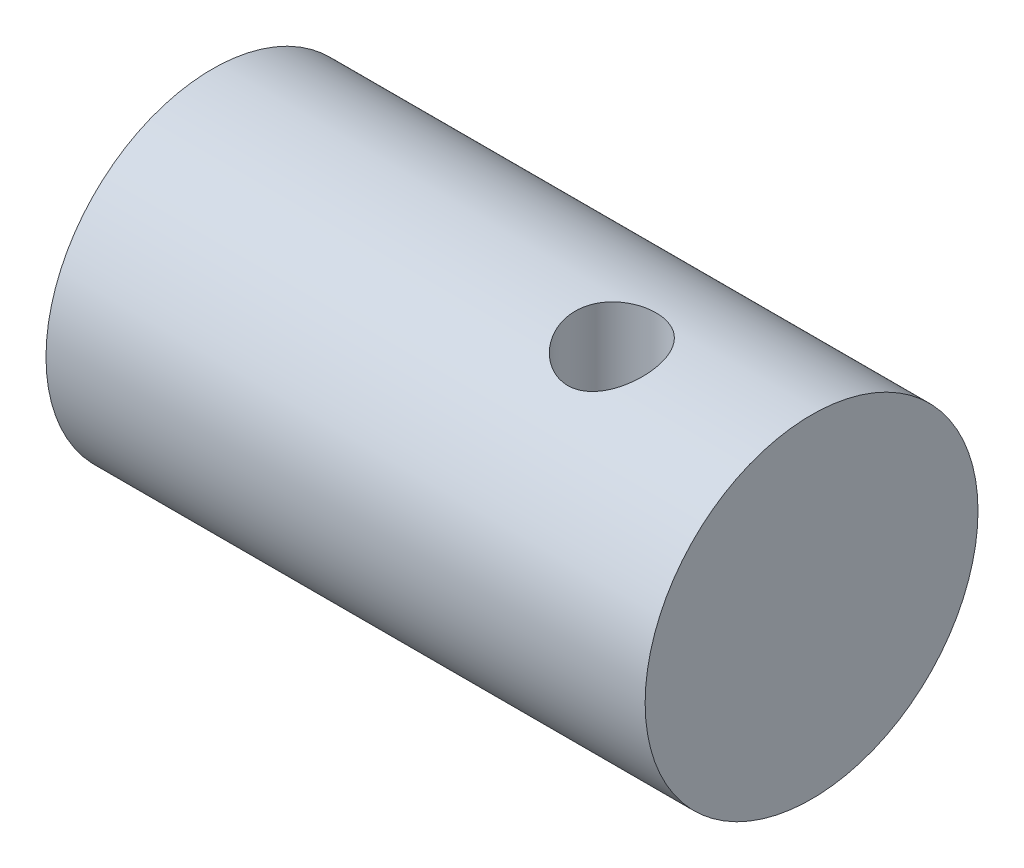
from build123d import *

# Parameters (mm, degrees)
EXTRUDE1_DEPTH      = 62.401577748
EXTRUDE1_DEPTH_BACK = 62.401577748
SKETCH2_R           = 4.2164


with BuildPart() as part:
    # Sketch1 → Revolve1 (revolve)
    with BuildSketch(Plane.XY, mode=Mode.PRIVATE) as revolve1_sk:
        Polygon((0, 0), (-5.08, 0), (-5.08, 6.5405), (-31.75, 6.5405), (-31.75, 10.3124), (-50.8, 10.3124), (-50.8, 12.7), (-57.15, 12.7), (-57.15, 15.875), (0, 15.875), align=None)
    revolve(revolve1_sk.sketch.rotate(Axis((0, 0, 0), (1, 0, 0)), 90), axis=Axis((0, 0, 0), (1, 0, 0)))

    # Sketch2 → Extrude1 (cut, two sides: drawn at the far end of the back side and taken through both)
    with BuildSketch(Plane(origin=(0, 0, 0), x_dir=(1, 0, 0), z_dir=(0, 1, 0)).offset(-EXTRUDE1_DEPTH_BACK)):
        with Locations(Location((-15.875, -3.175, 0), (0, 0, 270))):
            Circle(SKETCH2_R)
    extrude(amount=EXTRUDE1_DEPTH + EXTRUDE1_DEPTH_BACK, mode=Mode.SUBTRACT)


solid = part.part
